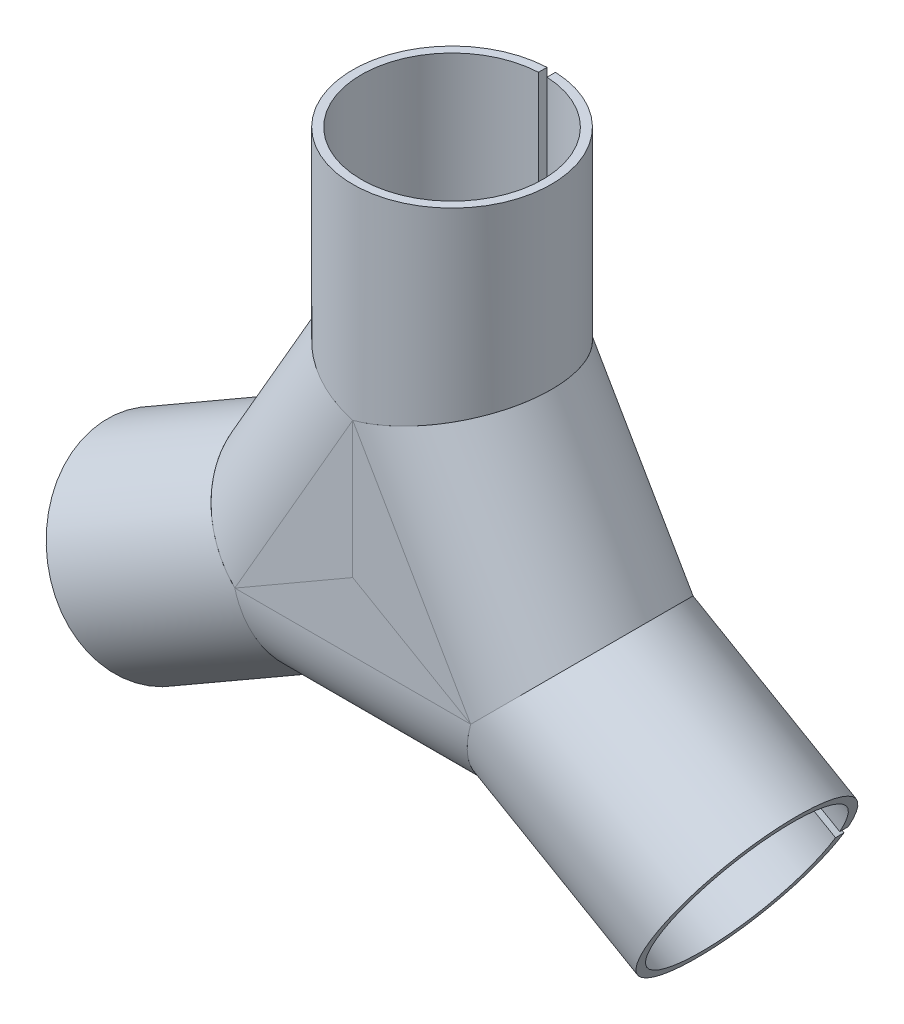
from build123d import *

# Parameters (mm, degrees)
SKETCH_2_R               = 11.665829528
SKETCH_2_R_2             = 10.665829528
EXTRUDE_1_DEPTH          = 40
EXTRUDE_2_DEPTH          = 13.856406
EXTRUDE_2_DEPTH_BACK     = 13.856406
SKETCH_3_R               = 11.665829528
SKETCH_3_R_2             = 10.665829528
CUT_EXTRUDE_1_DEPTH      = 49.063917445
CUT_EXTRUDE_1_DEPTH_BACK = 49.063917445
SKETCH_4_OUTSIDE_W       = 51.353
SKETCH_4_OUTSIDE_H       = 69.561
CUT_EXTRUDE_2_DEPTH      = 49.063917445
CUT_EXTRUDE_2_DEPTH_BACK = 49.063917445
SKETCH_5_OUTSIDE_W       = 51.353
SKETCH_5_OUTSIDE_H       = 69.561
EXTRUDE_1_2_DEPTH        = 1
SKETCH_1_W               = 1
SKETCH_1_H               = 40
CUT_EXTRUDE_2_2_DEPTH    = 48.304224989
PATTERN_CIRCULAR_1_COUNT = 3


with BuildPart() as part:
    # Sketch 2 → Extrude 1 (new body)
    with BuildSketch(Plane(origin=(0, 0, 0), x_dir=(1, 0, 0), z_dir=(0, 1, 0))):
        Circle(SKETCH_2_R)
        Circle(SKETCH_2_R_2, mode=Mode.SUBTRACT)
    extrude(amount=EXTRUDE_1_DEPTH)

    # Sketch 4 outside → Cut-Extrude 1 (cut, two sides: drawn at the far end of the back side and taken through both)
    with BuildSketch(Plane.XY.offset(-CUT_EXTRUDE_1_DEPTH_BACK)):
        with Locations((-6.1465, 13.0835)):
            Rectangle(SKETCH_4_OUTSIDE_W, SKETCH_4_OUTSIDE_H)
        Polygon((-11.665829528, 40), (-11.665829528, 19.125849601), (0, 16), (11.665829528, 19.125849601), (11.665829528, 40), align=None, mode=Mode.SUBTRACT)
    extrude(amount=CUT_EXTRUDE_1_DEPTH + CUT_EXTRUDE_1_DEPTH_BACK, mode=Mode.SUBTRACT)

    # Sketch 1 → Cut-Extrude 2 2 (cut, through all)
    with BuildSketch(Plane.XY):
        with Locations((0, 20)):
            Rectangle(SKETCH_1_W, SKETCH_1_H)
    extrude(amount=-CUT_EXTRUDE_2_2_DEPTH, mode=Mode.SUBTRACT)


with BuildPart() as body_2:
    # Sketch 3 → Extrude 2 (new, two sides: drawn at the far end of the back side and taken through both)
    with BuildSketch(Plane(origin=(-6.92820323, 4, 0), x_dir=(-0.8660254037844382, 0.500000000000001, 0), z_dir=(0.500000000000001, 0.8660254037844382, 0)).offset(-EXTRUDE_2_DEPTH_BACK)):
        Circle(SKETCH_3_R)
        Circle(SKETCH_3_R_2, mode=Mode.SUBTRACT)
    extrude(amount=EXTRUDE_2_DEPTH + EXTRUDE_2_DEPTH_BACK)

    # Sketch 5 outside → Cut-Extrude 2 (cut, two sides: drawn at the far end of the back side and taken through both)
    with BuildSketch(Plane.XY.offset(-CUT_EXTRUDE_2_DEPTH_BACK)):
        with Locations((-6.1465, 13.0835)):
            Rectangle(SKETCH_5_OUTSIDE_W, SKETCH_5_OUTSIDE_H)
        Polygon((-11.665829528, 19.125849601), (0, 16), (-13.856406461, -8), (-22.396386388, 0.539979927), align=None, mode=Mode.SUBTRACT)
    extrude(amount=CUT_EXTRUDE_2_DEPTH + CUT_EXTRUDE_2_DEPTH_BACK, mode=Mode.SUBTRACT)

    # Sketch 7 → Extrude 1 2 (add)
    with BuildSketch(Plane.XY.offset(11.665829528)):
        Polygon((0, 16), (0, 0), (-13.856406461, -8), align=None)
    extrude_1_2 = extrude(amount=-EXTRUDE_1_2_DEPTH)

    # Mirror 1: Extrude 1 2 across plane
    add(extrude_1_2.mirror(Plane.XY))


with BuildPart() as pattern_circular_1_1:
    # Pattern Circular 1: pattern copy
    add(body_2.part.rotate(Axis((0, 0, 0), (0, 0, 1)), 1 * 360 / PATTERN_CIRCULAR_1_COUNT))


with BuildPart() as pattern_circular_1_2:
    # Pattern Circular 1: pattern copy
    add(body_2.part.rotate(Axis((0, 0, 0), (0, 0, 1)), 2 * 360 / PATTERN_CIRCULAR_1_COUNT))


with BuildPart() as pattern_circular_1_3:
    # Pattern Circular 1: pattern copy
    add(part.part.rotate(Axis((0, 0, 0), (0, 0, 1)), 1 * 360 / PATTERN_CIRCULAR_1_COUNT))


with BuildPart() as pattern_circular_1_4:
    # Pattern Circular 1: pattern copy
    add(part.part.rotate(Axis((0, 0, 0), (0, 0, 1)), 2 * 360 / PATTERN_CIRCULAR_1_COUNT))


solid = Compound([part.part, body_2.part, pattern_circular_1_1.part, pattern_circular_1_2.part, pattern_circular_1_3.part, pattern_circular_1_4.part])
